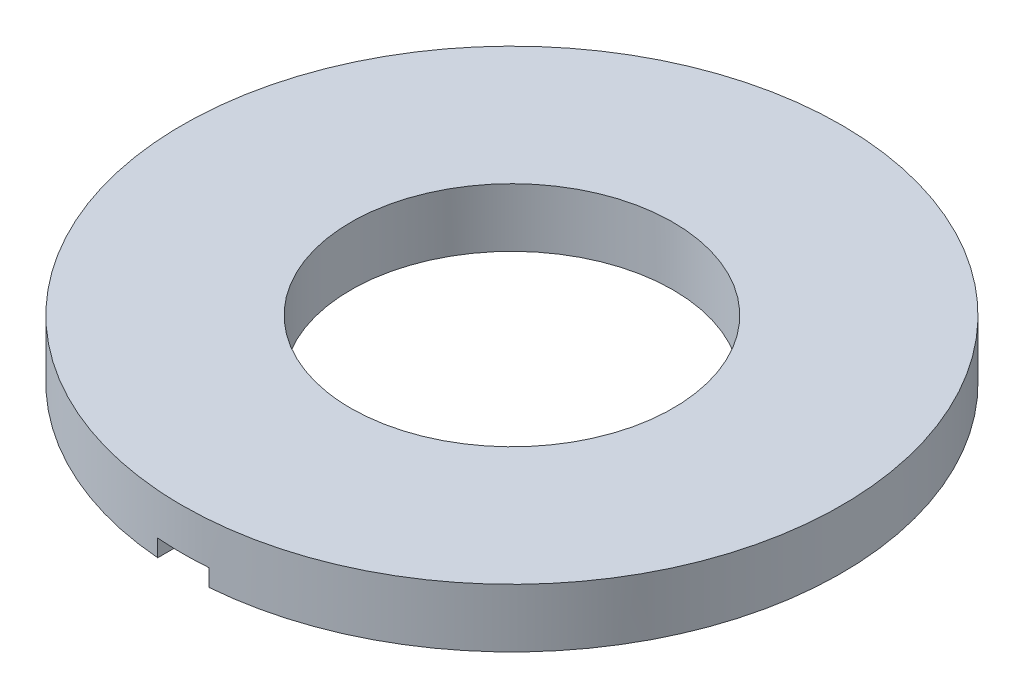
from build123d import *

# Parameters (mm, degrees)
SKETCH1_R          = 4.5
SKETCH1_R_2        = 2.2
EXTRUDE1_DEPTH     = 0.8
SKETCH2_W          = 0.7
SKETCH2_H          = 4.6
CUT_EXTRUDE1_DEPTH = 0.233333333


with BuildPart() as part:
    # Sketch1 → Extrude1 (new body)
    with BuildSketch(Plane(origin=(0, 0, 0), x_dir=(1, 0, 0), z_dir=(0, 1, 0))):
        with Locations(Location((0, 0, 0), (0, 0, 270))):
            Circle(SKETCH1_R)
        with Locations(Location((0, 0, 0), (0, 0, 270))):
            Circle(SKETCH1_R_2, mode=Mode.SUBTRACT)
    extrude(amount=EXTRUDE1_DEPTH)

    # Sketch2 → Cut-Extrude1 (cut)
    with BuildSketch(Plane.XZ):
        with Locations((0, 2.2)):
            Rectangle(SKETCH2_W, SKETCH2_H)
    extrude(amount=-CUT_EXTRUDE1_DEPTH, mode=Mode.SUBTRACT)


solid = part.part
